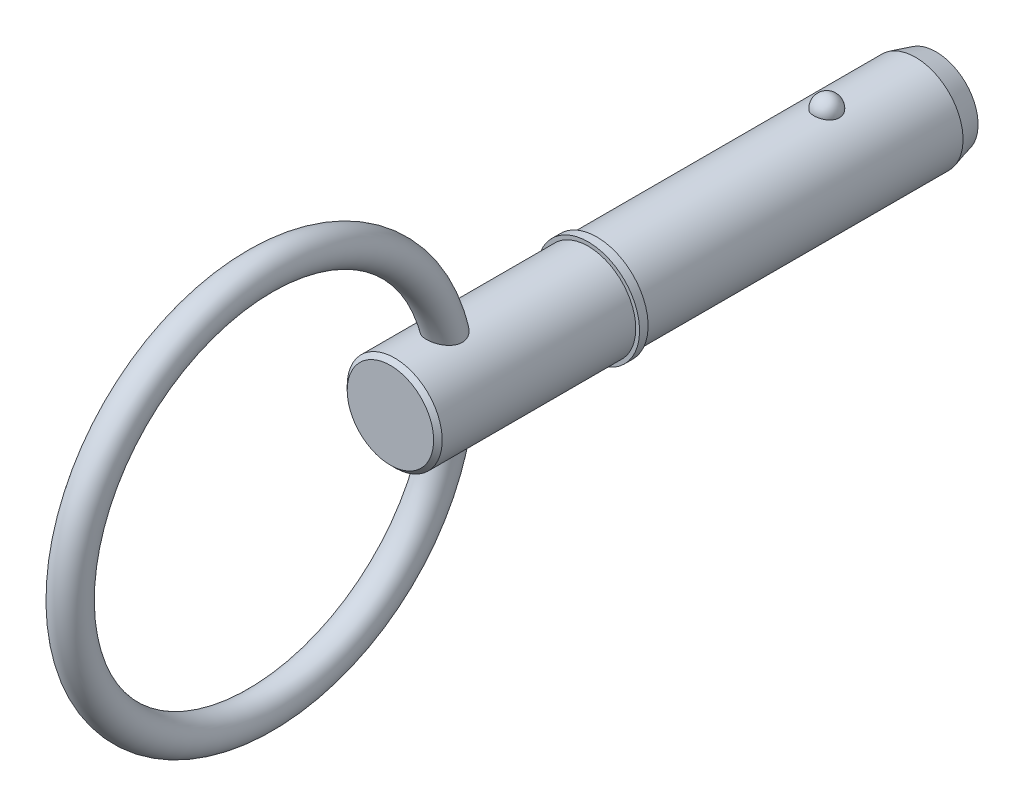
from build123d import *

# Parameters (mm, degrees)
SKETCH2_R           = 5.555
BOSS_EXTRUDE1_DEPTH = 25.4
BOSS_EXTRUDE2_START = 14.27
SKETCH3_R           = 5.555
BOSS_EXTRUDE2_DEPTH = 14.27
CHAMFER1_SIZE       = 2.4
CHAMFER1_SIZE2      = 0.643078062
SKETCH20_W          = 1
SKETCH20_H          = 6
SKETCH21_R          = 5.555
BOSS_EXTRUDE3_DEPTH = 24.13
CHAMFER2_SIZE       = 0.5
SKETCH24_R          = 2


with BuildPart() as part:
    # Sketch2 → Boss-Extrude1 (new body)
    with BuildSketch(Plane.XY):
        Circle(SKETCH2_R)
    extrude(amount=BOSS_EXTRUDE1_DEPTH)

    # Sketch3 → Boss-Extrude2 (add)
    with BuildSketch(Plane(origin=(0, 0, 0), x_dir=(-1, 0, 0), z_dir=(0, 0, -1)).offset(BOSS_EXTRUDE2_START)):
        Circle(SKETCH3_R)
    extrude(amount=-BOSS_EXTRUDE2_DEPTH)

    # Chamfer1
    chamfer1_edges = [part.edges().sort_by_distance(p)[0] for p in [
        (5.555, 0, -14.27),
    ]]
    chamfer1_side = [part.faces().sort_by_distance(p)[0] for p in [
        (5.555, 0, -7.135),
    ]]
    chamfer(chamfer1_edges, length=CHAMFER1_SIZE, length2=CHAMFER1_SIZE2, reference=chamfer1_side[0])

    # Sketch18 → Revolve1 (revolve)
    with BuildSketch(Plane(origin=(0, 0, 0), x_dir=(0, 0, -1), z_dir=(1, 0, 0))):
        with BuildLine():
            Line((1.49, 7.045), (1.49, 4.065))
            ThreePointArc((1.49, 4.065), (0, 5.555), (1.49, 7.045))
        make_face()
    revolve(axis=Axis((0, 7.045, -1.49), (0, -1, 0)))

    # Sketch20 → Revolve2 (revolve)
    with BuildSketch(Plane(origin=(0, 0, 0), x_dir=(0, 0, -1), z_dir=(1, 0, 0)), mode=Mode.PRIVATE) as revolve2_sk:
        with Locations((-25.9, 3)):
            Rectangle(SKETCH20_W, SKETCH20_H)
    revolve(revolve2_sk.sketch.rotate(Axis((0, 0, 33.728787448), (0, 0, 1)), 90), axis=Axis((0, 0, 33.728787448), (0, 0, 1)))

    # Sketch21 → Boss-Extrude3 (add)
    with BuildSketch(Plane(origin=(0, 0, 25.4), x_dir=(-1, 0, 0), z_dir=(0, 0, -1))):
        Circle(SKETCH21_R)
    extrude(amount=-BOSS_EXTRUDE3_DEPTH)

    # Chamfer2
    chamfer2_edges = [part.edges().sort_by_distance(p)[0] for p in [
        (5.555, 0, 49.53),
    ]]
    chamfer(chamfer2_edges, length=CHAMFER2_SIZE)

    # Sweep1: sweep along a path in Sketch23
    with BuildLine(Plane(origin=(0, 0, 0), x_dir=(0, 0, -1), z_dir=(1, 0, 0))) as sweep1_path:
        CenterArc((-64.755, 0), 22.225, 0, 360)
    # Sketch24 → Sweep1 (sweep)
    with BuildSketch(Plane(origin=(0, 0, 0), x_dir=(1, 0, 0), z_dir=(0, 1, 0))):
        with Locations((0, -42.53)):
            Circle(SKETCH24_R)
    sweep(path=sweep1_path.line)


solid = part.part
